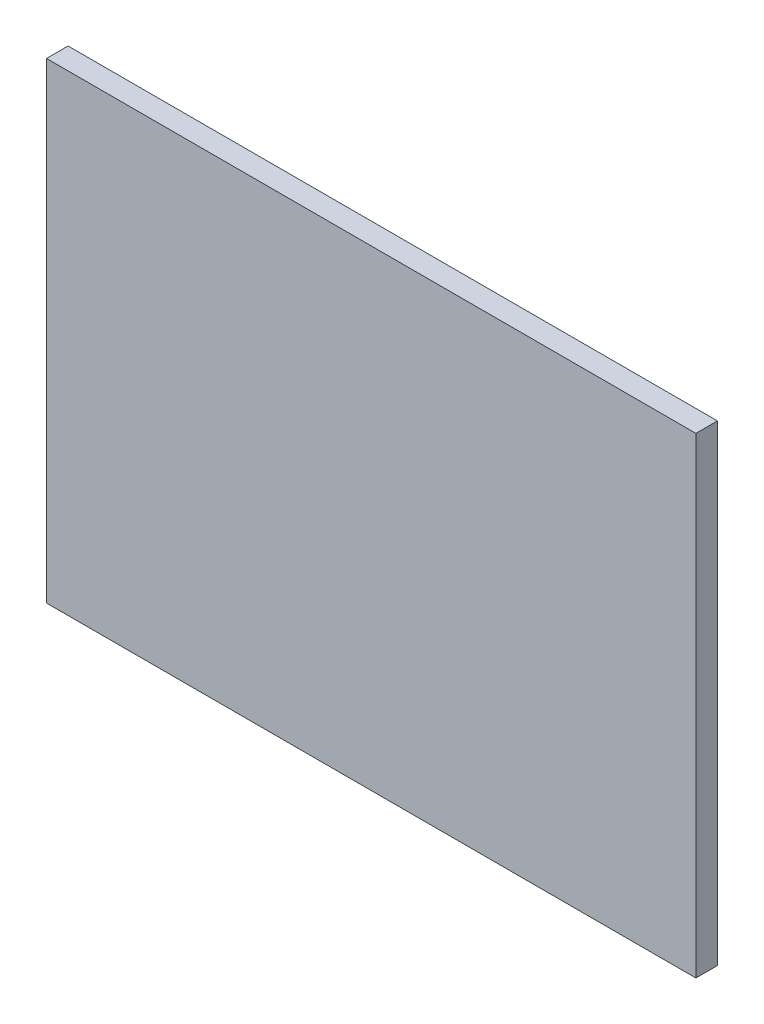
from build123d import *

# Parameters (mm, degrees)
ESQUISSE1_W        = 307
ESQUISSE1_H        = 223
BOSS_EXTRU_1_DEPTH = 5.1


with BuildPart() as part:
    # Esquisse1 → Boss.-Extru.1 (new, symmetric)
    with BuildSketch(Plane.XY):
        Rectangle(ESQUISSE1_W, ESQUISSE1_H)
    extrude(amount=BOSS_EXTRU_1_DEPTH, both=True)


solid = part.part
